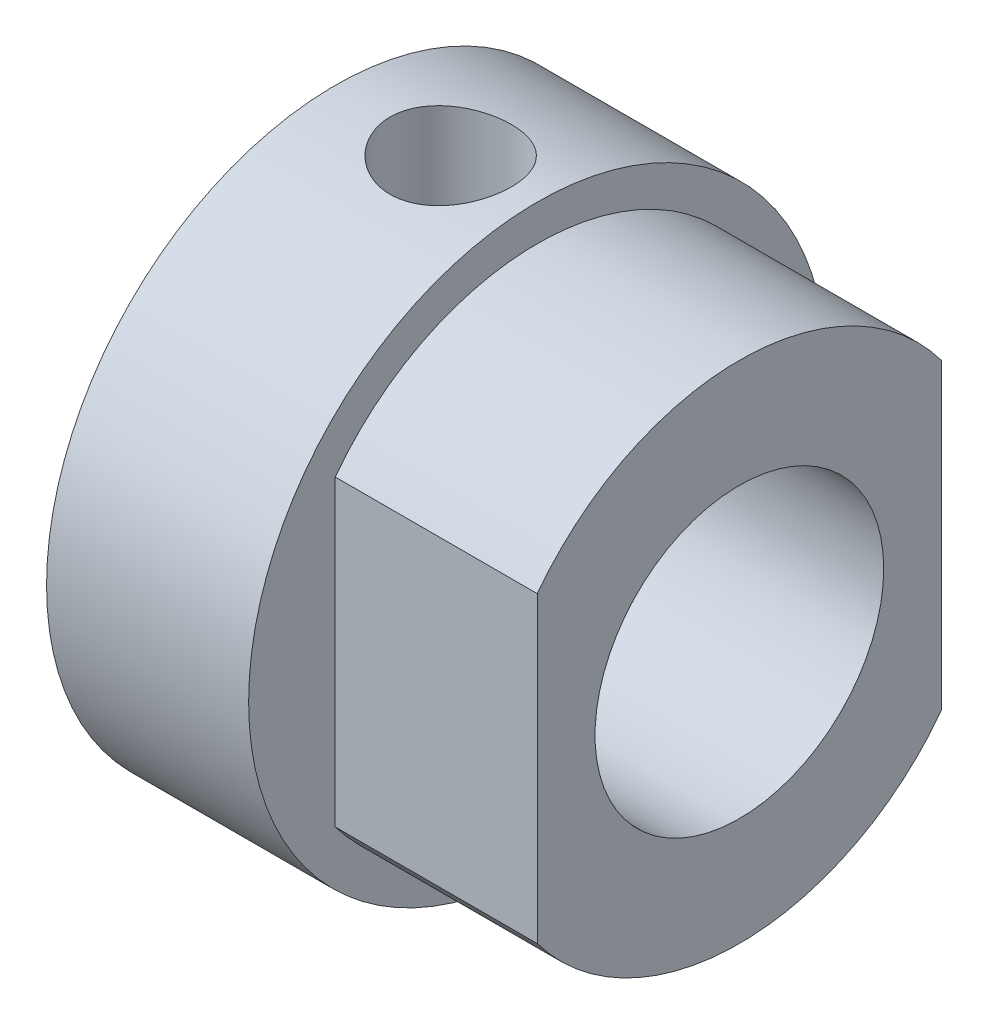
ISO-10303-21;
HEADER;
FILE_DESCRIPTION(('STEP AP214'),'2;1');
FILE_NAME('part.step','',(''),(''),'','','');
FILE_SCHEMA(('AUTOMOTIVE_DESIGN { 1 0 10303 214 1 1 1 1 }'));
ENDSEC;
DATA;
#1=APPLICATION_CONTEXT('core data for automotive mechanical design processes');
#2=APPLICATION_PROTOCOL_DEFINITION('international standard','automotive_design',2000,#1);
#3=PRODUCT_CONTEXT('',#1,'mechanical');
#4=PRODUCT('Part','Part','',(#3));
#5=PRODUCT_RELATED_PRODUCT_CATEGORY('part','',(#4));
#6=PRODUCT_DEFINITION_FORMATION('','',#4);
#7=PRODUCT_DEFINITION_CONTEXT('part definition',#1,'design');
#8=PRODUCT_DEFINITION('design','',#6,#7);
#9=PRODUCT_DEFINITION_SHAPE('','',#8);
#10=(LENGTH_UNIT() NAMED_UNIT(*) SI_UNIT(.MILLI.,.METRE.));
#11=(NAMED_UNIT(*) PLANE_ANGLE_UNIT() SI_UNIT($,.RADIAN.));
#12=(NAMED_UNIT(*) SI_UNIT($,.STERADIAN.) SOLID_ANGLE_UNIT());
#13=UNCERTAINTY_MEASURE_WITH_UNIT(LENGTH_MEASURE(1.E-05),#10,'distance_accuracy_value','');
#14=(GEOMETRIC_REPRESENTATION_CONTEXT(3) GLOBAL_UNCERTAINTY_ASSIGNED_CONTEXT((#13)) GLOBAL_UNIT_ASSIGNED_CONTEXT((#10,
#11,#12)) REPRESENTATION_CONTEXT('',''));
#15=CARTESIAN_POINT('',(0.,0.,0.));
#16=DIRECTION('',(0.,0.,1.));
#17=DIRECTION('',(1.,0.,0.));
#18=AXIS2_PLACEMENT_3D('',#15,#16,#17);
#19=CARTESIAN_POINT('',(0.,0.,0.));
#20=DIRECTION('',(1.,0.,0.));
#21=DIRECTION('',(0.,0.,-1.));
#22=AXIS2_PLACEMENT_3D('',#19,#20,#21);
#23=CYLINDRICAL_SURFACE('',#22,8.75);
#24=DIRECTION('',(-1.,0.,0.));
#25=VECTOR('',#24,1.);
#26=CARTESIAN_POINT('',(0.,5.25,-7.));
#27=LINE('',#26,#25);
#28=CARTESIAN_POINT('',(-7.,5.25,-7.));
#29=VERTEX_POINT('',#28);
#30=CARTESIAN_POINT('',(0.,5.25,-7.));
#31=VERTEX_POINT('',#30);
#32=EDGE_CURVE('E56',#29,#31,#27,.F.);
#33=ORIENTED_EDGE('',*,*,#32,.F.);
#34=CARTESIAN_POINT('',(-7.,0.,0.));
#35=DIRECTION('',(1.,0.,0.));
#36=DIRECTION('',(0.,0.,-1.));
#37=AXIS2_PLACEMENT_3D('',#34,#35,#36);
#38=CIRCLE('',#37,8.75);
#39=CARTESIAN_POINT('',(-7.,5.25,7.));
#40=VERTEX_POINT('',#39);
#41=EDGE_CURVE('E21',#29,#40,#38,.T.);
#42=ORIENTED_EDGE('',*,*,#41,.T.);
#43=DIRECTION('',(1.,0.,0.));
#44=VECTOR('',#43,1.);
#45=CARTESIAN_POINT('',(0.,5.25,7.));
#46=LINE('',#45,#44);
#47=CARTESIAN_POINT('',(0.,5.25,7.));
#48=VERTEX_POINT('',#47);
#49=EDGE_CURVE('E63',#48,#40,#46,.F.);
#50=ORIENTED_EDGE('',*,*,#49,.F.);
#51=CARTESIAN_POINT('',(0.,0.,0.));
#52=DIRECTION('',(1.,0.,0.));
#53=DIRECTION('',(0.,0.,-1.));
#54=AXIS2_PLACEMENT_3D('',#51,#52,#53);
#55=CIRCLE('',#54,8.75);
#56=EDGE_CURVE('E89',#31,#48,#55,.T.);
#57=ORIENTED_EDGE('',*,*,#56,.F.);
#58=EDGE_LOOP('',(#33,#42,#50,#57));
#59=FACE_BOUND('',#58,.T.);
#60=ADVANCED_FACE('F17',(#59),#23,.T.);
#61=CARTESIAN_POINT('',(0.,5.25,7.));
#62=DIRECTION('',(0.,0.,1.));
#63=DIRECTION('',(1.,0.,0.));
#64=AXIS2_PLACEMENT_3D('',#61,#62,#63);
#65=PLANE('',#64);
#66=ORIENTED_EDGE('',*,*,#49,.T.);
#67=DIRECTION('',(0.,1.,0.));
#68=VECTOR('',#67,1.);
#69=CARTESIAN_POINT('',(-7.,0.,7.));
#70=LINE('',#69,#68);
#71=CARTESIAN_POINT('',(-7.,-5.25,7.));
#72=VERTEX_POINT('',#71);
#73=EDGE_CURVE('E67',#40,#72,#70,.F.);
#74=ORIENTED_EDGE('',*,*,#73,.T.);
#75=DIRECTION('',(1.,0.,0.));
#76=VECTOR('',#75,1.);
#77=CARTESIAN_POINT('',(0.,-5.25,7.));
#78=LINE('',#77,#76);
#79=CARTESIAN_POINT('',(0.,-5.25,7.));
#80=VERTEX_POINT('',#79);
#81=EDGE_CURVE('E69',#80,#72,#78,.F.);
#82=ORIENTED_EDGE('',*,*,#81,.F.);
#83=DIRECTION('',(0.,1.,0.));
#84=VECTOR('',#83,1.);
#85=CARTESIAN_POINT('',(0.,0.,7.));
#86=LINE('',#85,#84);
#87=EDGE_CURVE('E68',#48,#80,#86,.F.);
#88=ORIENTED_EDGE('',*,*,#87,.F.);
#89=EDGE_LOOP('',(#66,#74,#82,#88));
#90=FACE_BOUND('',#89,.T.);
#91=ADVANCED_FACE('F65',(#90),#65,.T.);
#92=CARTESIAN_POINT('',(0.,0.,0.));
#93=DIRECTION('',(1.,0.,0.));
#94=DIRECTION('',(0.,0.,-1.));
#95=AXIS2_PLACEMENT_3D('',#92,#93,#94);
#96=CYLINDRICAL_SURFACE('',#95,8.75);
#97=ORIENTED_EDGE('',*,*,#81,.T.);
#98=CARTESIAN_POINT('',(-7.,0.,0.));
#99=DIRECTION('',(1.,0.,0.));
#100=DIRECTION('',(0.,0.,-1.));
#101=AXIS2_PLACEMENT_3D('',#98,#99,#100);
#102=CIRCLE('',#101,8.75);
#103=CARTESIAN_POINT('',(-7.,-5.25,-7.));
#104=VERTEX_POINT('',#103);
#105=EDGE_CURVE('E78',#72,#104,#102,.T.);
#106=ORIENTED_EDGE('',*,*,#105,.T.);
#107=DIRECTION('',(-1.,0.,0.));
#108=VECTOR('',#107,1.);
#109=CARTESIAN_POINT('',(0.,-5.25,-7.));
#110=LINE('',#109,#108);
#111=CARTESIAN_POINT('',(0.,-5.25,-7.));
#112=VERTEX_POINT('',#111);
#113=EDGE_CURVE('E81',#112,#104,#110,.T.);
#114=ORIENTED_EDGE('',*,*,#113,.F.);
#115=CARTESIAN_POINT('',(0.,0.,0.));
#116=DIRECTION('',(1.,0.,0.));
#117=DIRECTION('',(0.,0.,-1.));
#118=AXIS2_PLACEMENT_3D('',#115,#116,#117);
#119=CIRCLE('',#118,8.75);
#120=EDGE_CURVE('E36',#80,#112,#119,.T.);
#121=ORIENTED_EDGE('',*,*,#120,.F.);
#122=EDGE_LOOP('',(#97,#106,#114,#121));
#123=FACE_BOUND('',#122,.T.);
#124=ADVANCED_FACE('F123',(#123),#96,.T.);
#125=CARTESIAN_POINT('',(0.,-5.25,-7.));
#126=DIRECTION('',(0.,0.,-1.));
#127=DIRECTION('',(-1.,0.,0.));
#128=AXIS2_PLACEMENT_3D('',#125,#126,#127);
#129=PLANE('',#128);
#130=ORIENTED_EDGE('',*,*,#113,.T.);
#131=DIRECTION('',(0.,1.,0.));
#132=VECTOR('',#131,1.);
#133=CARTESIAN_POINT('',(-7.,0.,-7.));
#134=LINE('',#133,#132);
#135=EDGE_CURVE('E80',#104,#29,#134,.T.);
#136=ORIENTED_EDGE('',*,*,#135,.T.);
#137=ORIENTED_EDGE('',*,*,#32,.T.);
#138=DIRECTION('',(0.,1.,0.));
#139=VECTOR('',#138,1.);
#140=CARTESIAN_POINT('',(0.,0.,-7.));
#141=LINE('',#140,#139);
#142=EDGE_CURVE('E86',#112,#31,#141,.T.);
#143=ORIENTED_EDGE('',*,*,#142,.F.);
#144=EDGE_LOOP('',(#130,#136,#137,#143));
#145=FACE_BOUND('',#144,.T.);
#146=ADVANCED_FACE('F125',(#145),#129,.T.);
#147=CARTESIAN_POINT('',(-7.,0.,0.));
#148=DIRECTION('',(-1.,0.,0.));
#149=DIRECTION('',(0.,0.,1.));
#150=AXIS2_PLACEMENT_3D('',#147,#148,#149);
#151=PLANE('',#150);
#152=ORIENTED_EDGE('',*,*,#73,.F.);
#153=ORIENTED_EDGE('',*,*,#41,.F.);
#154=ORIENTED_EDGE('',*,*,#135,.F.);
#155=ORIENTED_EDGE('',*,*,#105,.F.);
#156=EDGE_LOOP('',(#152,#153,#154,#155));
#157=FACE_BOUND('',#156,.T.);
#158=CARTESIAN_POINT('',(-7.,0.,0.));
#159=DIRECTION('',(-1.,0.,0.));
#160=DIRECTION('',(0.,0.,1.));
#161=AXIS2_PLACEMENT_3D('',#158,#159,#160);
#162=CIRCLE('',#161,10.);
#163=CARTESIAN_POINT('',(-7.,0.,10.));
#164=VERTEX_POINT('',#163);
#165=EDGE_CURVE('E120',#164,#164,#162,.T.);
#166=ORIENTED_EDGE('',*,*,#165,.F.);
#167=EDGE_LOOP('',(#166));
#168=FACE_BOUND('',#167,.T.);
#169=ADVANCED_FACE('F73',(#157,#168),#151,.F.);
#170=CARTESIAN_POINT('',(0.,0.,0.));
#171=DIRECTION('',(1.,0.,0.));
#172=DIRECTION('',(0.,0.,-1.));
#173=AXIS2_PLACEMENT_3D('',#170,#171,#172);
#174=PLANE('',#173);
#175=CARTESIAN_POINT('',(0.,0.,0.));
#176=DIRECTION('',(1.,0.,0.));
#177=DIRECTION('',(0.,0.,-1.));
#178=AXIS2_PLACEMENT_3D('',#175,#176,#177);
#179=CIRCLE('',#178,5.);
#180=CARTESIAN_POINT('',(0.,0.,-5.));
#181=VERTEX_POINT('',#180);
#182=EDGE_CURVE('E101',#181,#181,#179,.F.);
#183=ORIENTED_EDGE('',*,*,#182,.T.);
#184=EDGE_LOOP('',(#183));
#185=FACE_BOUND('',#184,.T.);
#186=ORIENTED_EDGE('',*,*,#120,.T.);
#187=ORIENTED_EDGE('',*,*,#142,.T.);
#188=ORIENTED_EDGE('',*,*,#56,.T.);
#189=ORIENTED_EDGE('',*,*,#87,.T.);
#190=EDGE_LOOP('',(#186,#187,#188,#189));
#191=FACE_BOUND('',#190,.T.);
#192=ADVANCED_FACE('F126',(#185,#191),#174,.T.);
#193=CARTESIAN_POINT('',(-10.,0.,0.));
#194=DIRECTION('',(0.,1.,0.));
#195=DIRECTION('',(0.,0.,1.));
#196=AXIS2_PLACEMENT_3D('',#193,#194,#195);
#197=CYLINDRICAL_SURFACE('',#196,2.1);
#198=CARTESIAN_POINT('',(-12.1,10.,0.));
#199=CARTESIAN_POINT('',(-12.0999943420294,9.99999714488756,-0.116461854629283));
#200=CARTESIAN_POINT('',(-12.0902699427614,9.99794269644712,-0.233066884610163));
#201=CARTESIAN_POINT('',(-12.0516373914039,9.98993854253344,-0.463068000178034));
#202=CARTESIAN_POINT('',(-12.0226916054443,9.98398119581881,-0.576457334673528));
#203=CARTESIAN_POINT('',(-11.9465544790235,9.96883601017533,-0.796526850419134));
#204=CARTESIAN_POINT('',(-11.8993899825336,9.9596529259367,-0.903216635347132));
#205=CARTESIAN_POINT('',(-11.7882252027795,9.93905320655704,-1.10713016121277));
#206=CARTESIAN_POINT('',(-11.7242302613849,9.92763728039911,-1.20435689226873));
#207=CARTESIAN_POINT('',(-11.5801996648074,9.90363238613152,-1.38808312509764));
#208=CARTESIAN_POINT('',(-11.4999601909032,9.89102972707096,-1.47442108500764));
#209=CARTESIAN_POINT('',(-11.3261523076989,9.86616926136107,-1.63252084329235));
#210=CARTESIAN_POINT('',(-11.2325820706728,9.85391150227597,-1.70428063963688));
#211=CARTESIAN_POINT('',(-11.0336049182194,9.83099649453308,-1.83187516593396));
#212=CARTESIAN_POINT('',(-10.9280880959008,9.82035664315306,-1.88754190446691));
#213=CARTESIAN_POINT('',(-10.7089387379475,9.80207584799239,-1.9802925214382));
#214=CARTESIAN_POINT('',(-10.595307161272,9.79443455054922,-2.01737859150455));
#215=CARTESIAN_POINT('',(-10.364884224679,9.78315377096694,-2.07139083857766));
#216=CARTESIAN_POINT('',(-10.2481618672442,9.77945828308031,-2.0885994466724));
#217=CARTESIAN_POINT('',(-10.0134325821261,9.77631916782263,-2.10324601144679));
#218=CARTESIAN_POINT('',(-9.89542579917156,9.7768750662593,-2.10068617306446));
#219=CARTESIAN_POINT('',(-9.66356230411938,9.78212511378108,-2.07609635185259));
#220=CARTESIAN_POINT('',(-9.54966919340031,9.78674993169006,-2.0543925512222));
#221=CARTESIAN_POINT('',(-9.32717669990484,9.7995073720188,-1.99264647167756));
#222=CARTESIAN_POINT('',(-9.21857763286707,9.80764020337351,-1.95260310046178));
#223=CARTESIAN_POINT('',(-9.00882576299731,9.82656713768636,-1.8550079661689));
#224=CARTESIAN_POINT('',(-8.90773423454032,9.83738055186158,-1.79732841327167));
#225=CARTESIAN_POINT('',(-8.716550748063,9.86043714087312,-1.66619265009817));
#226=CARTESIAN_POINT('',(-8.62645938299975,9.87268039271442,-1.59273558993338));
#227=CARTESIAN_POINT('',(-8.45796046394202,9.89751445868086,-1.43040806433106));
#228=CARTESIAN_POINT('',(-8.37981816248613,9.91010736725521,-1.34126236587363));
#229=CARTESIAN_POINT('',(-8.23951828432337,9.9340072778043,-1.15094828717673));
#230=CARTESIAN_POINT('',(-8.17736769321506,9.94531371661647,-1.04977468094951));
#231=CARTESIAN_POINT('',(-8.07076125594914,9.96540039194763,-0.837939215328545));
#232=CARTESIAN_POINT('',(-8.02635227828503,9.97417392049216,-0.727253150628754));
#233=CARTESIAN_POINT('',(-7.95692261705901,9.98814259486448,-0.499906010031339));
#234=CARTESIAN_POINT('',(-7.93186129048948,9.9933452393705,-0.383258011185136));
#235=CARTESIAN_POINT('',(-7.91123272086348,9.99764626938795,-0.221423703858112));
#236=CARTESIAN_POINT('',(-7.90702414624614,9.99852690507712,-0.177254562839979));
#237=CARTESIAN_POINT('',(-7.90140670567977,9.99970431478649,-0.088730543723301));
#238=CARTESIAN_POINT('',(-7.89999784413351,10.0000010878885,-0.0443756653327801));
#239=CARTESIAN_POINT('',(-7.90000565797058,9.99999714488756,0.116461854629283));
#240=CARTESIAN_POINT('',(-7.90973005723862,9.99794269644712,0.233066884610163));
#241=CARTESIAN_POINT('',(-7.94836260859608,9.98993854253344,0.463068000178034));
#242=CARTESIAN_POINT('',(-7.97730839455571,9.98398119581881,0.576457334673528));
#243=CARTESIAN_POINT('',(-8.05344552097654,9.96883601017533,0.796526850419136));
#244=CARTESIAN_POINT('',(-8.10061001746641,9.9596529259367,0.903216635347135));
#245=CARTESIAN_POINT('',(-8.21177479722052,9.93905320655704,1.10713016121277));
#246=CARTESIAN_POINT('',(-8.27576973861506,9.92763728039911,1.20435689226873));
#247=CARTESIAN_POINT('',(-8.41980033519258,9.90363238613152,1.38808312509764));
#248=CARTESIAN_POINT('',(-8.50003980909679,9.89102972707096,1.47442108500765));
#249=CARTESIAN_POINT('',(-8.67384769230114,9.86616926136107,1.63252084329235));
#250=CARTESIAN_POINT('',(-8.7674179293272,9.85391150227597,1.70428063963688));
#251=CARTESIAN_POINT('',(-8.96639508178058,9.83099649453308,1.83187516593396));
#252=CARTESIAN_POINT('',(-9.07191190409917,9.82035664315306,1.88754190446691));
#253=CARTESIAN_POINT('',(-9.2910612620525,9.80207584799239,1.98029252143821));
#254=CARTESIAN_POINT('',(-9.40469283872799,9.79443455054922,2.01737859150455));
#255=CARTESIAN_POINT('',(-9.63511577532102,9.78315377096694,2.07139083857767));
#256=CARTESIAN_POINT('',(-9.75183813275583,9.77945828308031,2.0885994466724));
#257=CARTESIAN_POINT('',(-9.98656741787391,9.77631916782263,2.10324601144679));
#258=CARTESIAN_POINT('',(-10.1045742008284,9.7768750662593,2.10068617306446));
#259=CARTESIAN_POINT('',(-10.3364376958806,9.78212511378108,2.07609635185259));
#260=CARTESIAN_POINT('',(-10.4503308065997,9.78674993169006,2.0543925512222));
#261=CARTESIAN_POINT('',(-10.6728233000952,9.7995073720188,1.99264647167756));
#262=CARTESIAN_POINT('',(-10.7814223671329,9.80764020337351,1.95260310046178));
#263=CARTESIAN_POINT('',(-10.9911742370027,9.82656713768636,1.8550079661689));
#264=CARTESIAN_POINT('',(-11.0922657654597,9.83738055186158,1.79732841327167));
#265=CARTESIAN_POINT('',(-11.283449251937,9.86043714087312,1.66619265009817));
#266=CARTESIAN_POINT('',(-11.3735406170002,9.87268039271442,1.59273558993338));
#267=CARTESIAN_POINT('',(-11.542039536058,9.89751445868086,1.43040806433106));
#268=CARTESIAN_POINT('',(-11.6201818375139,9.91010736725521,1.34126236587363));
#269=CARTESIAN_POINT('',(-11.7604817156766,9.9340072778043,1.15094828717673));
#270=CARTESIAN_POINT('',(-11.8226323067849,9.94531371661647,1.04977468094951));
#271=CARTESIAN_POINT('',(-11.9292387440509,9.96540039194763,0.837939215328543));
#272=CARTESIAN_POINT('',(-11.973647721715,9.97417392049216,0.727253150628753));
#273=CARTESIAN_POINT('',(-12.043077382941,9.98814259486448,0.499906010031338));
#274=CARTESIAN_POINT('',(-12.0681387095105,9.9933452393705,0.383258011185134));
#275=CARTESIAN_POINT('',(-12.0887672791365,9.99764626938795,0.221423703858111));
#276=CARTESIAN_POINT('',(-12.0929758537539,9.99852690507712,0.177254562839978));
#277=CARTESIAN_POINT('',(-12.0985932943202,9.99970431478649,0.0887305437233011));
#278=CARTESIAN_POINT('',(-12.1000021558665,10.0000010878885,0.04437566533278));
#279=CARTESIAN_POINT('',(-12.1,10.,0.));
#280=B_SPLINE_CURVE_WITH_KNOTS('',3,(#198,#199,#200,#201,#202,#203,#204,#205,#206,#207,#208,
#209,#210,#211,#212,#213,#214,#215,#216,#217,#218,#219,#220,#221,#222,#223,#224,#225,#226,#227,
#228,#229,#230,#231,#232,#233,#234,#235,#236,#237,#238,#239,#240,#241,#242,#243,#244,#245,#246,
#247,#248,#249,#250,#251,#252,#253,#254,#255,#256,#257,#258,#259,#260,#261,#262,#263,#264,#265,
#266,#267,#268,#269,#270,#271,#272,#273,#274,#275,#276,#277,#278,#279),.UNSPECIFIED.,.T.,.F.,(4,
2,2,2,2,2,2,2,2,2,2,2,2,2,2,2,2,2,2,2,2,2,2,2,2,2,2,2,2,2,2,2,2,2,2,2,2,2,2,2,4),(0.,
0.349215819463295,0.699117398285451,1.04850537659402,1.39778259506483,1.75174900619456,
2.10576399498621,2.46335103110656,2.82089587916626,3.1732954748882,3.52565576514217,
3.87212592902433,4.21861673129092,4.567680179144,4.91676243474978,5.27272431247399,
5.62884142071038,5.98589316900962,6.34219281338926,6.47525492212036,6.60831724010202,
6.95753305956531,7.30743463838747,7.65682261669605,8.00609983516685,8.36006624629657,
8.71408123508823,9.07166827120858,9.42921311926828,9.78161271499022,10.1339730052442,
10.4804431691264,10.8269339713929,11.175997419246,11.5250796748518,11.881041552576,
12.2371586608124,12.5942104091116,12.9505100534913,13.0835721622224,13.216634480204),.UNSPECIFIED.);
#281=CARTESIAN_POINT('',(-12.1,10.,0.));
#282=VERTEX_POINT('',#281);
#283=EDGE_CURVE('E88',#282,#282,#280,.T.);
#284=ORIENTED_EDGE('',*,*,#283,.F.);
#285=EDGE_LOOP('',(#284));
#286=FACE_BOUND('',#285,.T.);
#287=CARTESIAN_POINT('',(-7.9,5.,0.));
#288=CARTESIAN_POINT('',(-7.9000065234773,4.99999469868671,0.112528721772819));
#289=CARTESIAN_POINT('',(-7.90908928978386,4.99616148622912,0.225149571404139));
#290=CARTESIAN_POINT('',(-7.94505918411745,4.98121717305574,0.447096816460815));
#291=CARTESIAN_POINT('',(-7.97197047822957,4.97009619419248,0.556418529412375));
#292=CARTESIAN_POINT('',(-8.04242740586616,4.94176660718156,0.768336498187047));
#293=CARTESIAN_POINT('',(-8.08592399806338,4.92457595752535,0.87095154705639));
#294=CARTESIAN_POINT('',(-8.18809457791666,4.88577253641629,1.06736277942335));
#295=CARTESIAN_POINT('',(-8.24676883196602,4.86415968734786,1.16115880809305));
#296=CARTESIAN_POINT('',(-8.38076405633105,4.8174479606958,1.34213733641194));
#297=CARTESIAN_POINT('',(-8.45673043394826,4.79223395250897,1.42881195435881));
#298=CARTESIAN_POINT('',(-8.62178347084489,4.74165722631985,1.58862387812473));
#299=CARTESIAN_POINT('',(-8.71087617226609,4.71629444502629,1.66175491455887));
#300=CARTESIAN_POINT('',(-8.9050774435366,4.66686374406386,1.79604142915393));
#301=CARTESIAN_POINT('',(-9.01076556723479,4.64292478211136,1.85641123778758));
#302=CARTESIAN_POINT('',(-9.23194797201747,4.6008869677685,1.95828984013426));
#303=CARTESIAN_POINT('',(-9.34743720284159,4.58278513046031,1.99980827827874));
#304=CARTESIAN_POINT('',(-9.57908132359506,4.5557228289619,2.0606933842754));
#305=CARTESIAN_POINT('',(-9.69492956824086,4.54635991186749,2.08104086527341));
#306=CARTESIAN_POINT('',(-9.92874526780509,4.53668036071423,2.10206556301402));
#307=CARTESIAN_POINT('',(-10.0467114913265,4.53635863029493,2.10275386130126));
#308=CARTESIAN_POINT('',(-10.2715726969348,4.54445782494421,2.08517839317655));
#309=CARTESIAN_POINT('',(-10.3786125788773,4.55219765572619,2.06839113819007));
#310=CARTESIAN_POINT('',(-10.588185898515,4.57439531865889,2.01882071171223));
#311=CARTESIAN_POINT('',(-10.6907184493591,4.58885446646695,1.98603440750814));
#312=CARTESIAN_POINT('',(-10.8909790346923,4.62318991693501,1.90475453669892));
#313=CARTESIAN_POINT('',(-10.9885567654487,4.64317580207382,1.85593902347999));
#314=CARTESIAN_POINT('',(-11.1745157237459,4.68628734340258,1.74421616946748));
#315=CARTESIAN_POINT('',(-11.2628936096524,4.70941413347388,1.68130373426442));
#316=CARTESIAN_POINT('',(-11.4359375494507,4.7586184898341,1.53683175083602));
#317=CARTESIAN_POINT('',(-11.5196330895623,4.78477890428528,1.45413482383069));
#318=CARTESIAN_POINT('',(-11.6723196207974,4.83543741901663,1.2755973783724));
#319=CARTESIAN_POINT('',(-11.7413031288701,4.85993466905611,1.17975021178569));
#320=CARTESIAN_POINT('',(-11.8640705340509,4.9052441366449,0.974614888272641));
#321=CARTESIAN_POINT('',(-11.9174425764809,4.92595187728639,0.865055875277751));
#322=CARTESIAN_POINT('',(-12.0045810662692,4.96051713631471,0.637518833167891));
#323=CARTESIAN_POINT('',(-12.0383865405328,4.97438828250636,0.519558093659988));
#324=CARTESIAN_POINT('',(-12.0743975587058,4.98928935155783,0.333710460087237));
#325=CARTESIAN_POINT('',(-12.0839816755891,4.99329013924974,0.267407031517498));
#326=CARTESIAN_POINT('',(-12.0967847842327,4.99864701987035,0.134079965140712));
#327=CARTESIAN_POINT('',(-12.1000038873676,5.00000315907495,0.067056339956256));
#328=CARTESIAN_POINT('',(-12.0999934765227,4.99999469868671,-0.11252872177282));
#329=CARTESIAN_POINT('',(-12.0909107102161,4.99616148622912,-0.225149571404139));
#330=CARTESIAN_POINT('',(-12.0549408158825,4.98121717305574,-0.447096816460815));
#331=CARTESIAN_POINT('',(-12.0280295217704,4.97009619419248,-0.556418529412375));
#332=CARTESIAN_POINT('',(-11.9575725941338,4.94176660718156,-0.768336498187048));
#333=CARTESIAN_POINT('',(-11.9140760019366,4.92457595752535,-0.87095154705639));
#334=CARTESIAN_POINT('',(-11.8119054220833,4.88577253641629,-1.06736277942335));
#335=CARTESIAN_POINT('',(-11.753231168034,4.86415968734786,-1.16115880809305));
#336=CARTESIAN_POINT('',(-11.6192359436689,4.8174479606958,-1.34213733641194));
#337=CARTESIAN_POINT('',(-11.5432695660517,4.79223395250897,-1.42881195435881));
#338=CARTESIAN_POINT('',(-11.3782165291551,4.74165722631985,-1.58862387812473));
#339=CARTESIAN_POINT('',(-11.2891238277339,4.71629444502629,-1.66175491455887));
#340=CARTESIAN_POINT('',(-11.0949225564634,4.66686374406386,-1.79604142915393));
#341=CARTESIAN_POINT('',(-10.9892344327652,4.64292478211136,-1.85641123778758));
#342=CARTESIAN_POINT('',(-10.7680520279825,4.6008869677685,-1.95828984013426));
#343=CARTESIAN_POINT('',(-10.6525627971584,4.58278513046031,-1.99980827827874));
#344=CARTESIAN_POINT('',(-10.4209186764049,4.5557228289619,-2.0606933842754));
#345=CARTESIAN_POINT('',(-10.3050704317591,4.54635991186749,-2.08104086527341));
#346=CARTESIAN_POINT('',(-10.0712547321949,4.53668036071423,-2.10206556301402));
#347=CARTESIAN_POINT('',(-9.9532885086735,4.53635863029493,-2.10275386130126));
#348=CARTESIAN_POINT('',(-9.72842730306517,4.54445782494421,-2.08517839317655));
#349=CARTESIAN_POINT('',(-9.62138742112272,4.55219765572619,-2.06839113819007));
#350=CARTESIAN_POINT('',(-9.41181410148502,4.57439531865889,-2.01882071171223));
#351=CARTESIAN_POINT('',(-9.3092815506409,4.58885446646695,-1.98603440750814));
#352=CARTESIAN_POINT('',(-9.10902096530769,4.62318991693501,-1.90475453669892));
#353=CARTESIAN_POINT('',(-9.01144323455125,4.64317580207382,-1.85593902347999));
#354=CARTESIAN_POINT('',(-8.82548427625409,4.68628734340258,-1.74421616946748));
#355=CARTESIAN_POINT('',(-8.73710639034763,4.70941413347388,-1.68130373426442));
#356=CARTESIAN_POINT('',(-8.56406245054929,4.7586184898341,-1.53683175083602));
#357=CARTESIAN_POINT('',(-8.48036691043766,4.78477890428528,-1.45413482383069));
#358=CARTESIAN_POINT('',(-8.32768037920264,4.83543741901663,-1.27559737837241));
#359=CARTESIAN_POINT('',(-8.25869687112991,4.85993466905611,-1.17975021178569));
#360=CARTESIAN_POINT('',(-8.13592946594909,4.9052441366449,-0.974614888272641));
#361=CARTESIAN_POINT('',(-8.08255742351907,4.92595187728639,-0.865055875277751));
#362=CARTESIAN_POINT('',(-7.99541893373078,4.96051713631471,-0.637518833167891));
#363=CARTESIAN_POINT('',(-7.96161345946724,4.97438828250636,-0.519558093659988));
#364=CARTESIAN_POINT('',(-7.92560244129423,4.98928935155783,-0.333710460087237));
#365=CARTESIAN_POINT('',(-7.91601832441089,4.99329013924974,-0.267407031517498));
#366=CARTESIAN_POINT('',(-7.90321521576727,4.99864701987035,-0.134079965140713));
#367=CARTESIAN_POINT('',(-7.89999611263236,5.00000315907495,-0.0670563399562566));
#368=CARTESIAN_POINT('',(-7.9,5.,0.));
#369=B_SPLINE_CURVE_WITH_KNOTS('',3,(#287,#288,#289,#290,#291,#292,#293,#294,#295,#296,#297,
#298,#299,#300,#301,#302,#303,#304,#305,#306,#307,#308,#309,#310,#311,#312,#313,#314,#315,#316,
#317,#318,#319,#320,#321,#322,#323,#324,#325,#326,#327,#328,#329,#330,#331,#332,#333,#334,#335,
#336,#337,#338,#339,#340,#341,#342,#343,#344,#345,#346,#347,#348,#349,#350,#351,#352,#353,#354,
#355,#356,#357,#358,#359,#360,#361,#362,#363,#364,#365,#366,#367,#368),.UNSPECIFIED.,.T.,.F.,(4,
2,2,2,2,2,2,2,2,2,2,2,2,2,2,2,2,2,2,2,2,2,2,2,2,2,2,2,2,2,2,2,2,2,2,2,2,2,2,2,4),(0.,
0.337325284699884,0.675108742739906,1.01190105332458,1.34869927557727,1.70110458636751,
2.0536726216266,2.42394328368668,2.79402429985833,3.14607233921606,3.49792193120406,
3.82228173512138,4.14670507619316,4.47808981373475,4.80959450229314,5.16956743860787,
5.52972303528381,5.8986647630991,6.26686805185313,6.46788512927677,6.66889868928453,
7.00622397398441,7.34400743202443,7.68079974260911,8.0175979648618,8.37000327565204,
8.72257131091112,9.0928419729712,9.46292298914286,9.81497102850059,10.1668206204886,
10.4911804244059,10.8156037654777,11.1469885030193,11.4784931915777,11.8384661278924,
12.1986217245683,12.5675634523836,12.9357667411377,13.1367838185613,13.3377973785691),.UNSPECIFIED.);
#370=CARTESIAN_POINT('',(-7.9,5.,0.));
#371=VERTEX_POINT('',#370);
#372=EDGE_CURVE('E95',#371,#371,#369,.T.);
#373=ORIENTED_EDGE('',*,*,#372,.T.);
#374=EDGE_LOOP('',(#373));
#375=FACE_BOUND('',#374,.T.);
#376=ADVANCED_FACE('F103',(#286,#375),#197,.F.);
#377=CARTESIAN_POINT('',(-14.,0.,0.));
#378=DIRECTION('',(-1.,0.,0.));
#379=DIRECTION('',(0.,0.,1.));
#380=AXIS2_PLACEMENT_3D('',#377,#378,#379);
#381=CYLINDRICAL_SURFACE('',#380,10.);
#382=ORIENTED_EDGE('',*,*,#165,.T.);
#383=EDGE_LOOP('',(#382));
#384=FACE_BOUND('',#383,.T.);
#385=CARTESIAN_POINT('',(-14.,0.,0.));
#386=DIRECTION('',(-1.,0.,0.));
#387=DIRECTION('',(0.,0.,1.));
#388=AXIS2_PLACEMENT_3D('',#385,#386,#387);
#389=CIRCLE('',#388,10.);
#390=CARTESIAN_POINT('',(-14.,0.,10.));
#391=VERTEX_POINT('',#390);
#392=EDGE_CURVE('E27',#391,#391,#389,.F.);
#393=ORIENTED_EDGE('',*,*,#392,.T.);
#394=EDGE_LOOP('',(#393));
#395=FACE_BOUND('',#394,.T.);
#396=ORIENTED_EDGE('',*,*,#283,.T.);
#397=EDGE_LOOP('',(#396));
#398=FACE_BOUND('',#397,.T.);
#399=ADVANCED_FACE('F110',(#384,#395,#398),#381,.T.);
#400=CARTESIAN_POINT('',(0.,0.,0.));
#401=DIRECTION('',(1.,0.,0.));
#402=DIRECTION('',(0.,0.,-1.));
#403=AXIS2_PLACEMENT_3D('',#400,#401,#402);
#404=CYLINDRICAL_SURFACE('',#403,5.);
#405=CARTESIAN_POINT('',(-14.,0.,0.));
#406=DIRECTION('',(1.,0.,0.));
#407=DIRECTION('',(0.,0.,-1.));
#408=AXIS2_PLACEMENT_3D('',#405,#406,#407);
#409=CIRCLE('',#408,5.);
#410=CARTESIAN_POINT('',(-14.,0.,-5.));
#411=VERTEX_POINT('',#410);
#412=EDGE_CURVE('E11',#411,#411,#409,.F.);
#413=ORIENTED_EDGE('',*,*,#412,.T.);
#414=EDGE_LOOP('',(#413));
#415=FACE_BOUND('',#414,.T.);
#416=ORIENTED_EDGE('',*,*,#372,.F.);
#417=EDGE_LOOP('',(#416));
#418=FACE_BOUND('',#417,.T.);
#419=ORIENTED_EDGE('',*,*,#182,.F.);
#420=EDGE_LOOP('',(#419));
#421=FACE_BOUND('',#420,.T.);
#422=ADVANCED_FACE('F107',(#415,#418,#421),#404,.F.);
#423=CARTESIAN_POINT('',(-14.,0.,0.));
#424=DIRECTION('',(1.,0.,0.));
#425=DIRECTION('',(0.,0.,-1.));
#426=AXIS2_PLACEMENT_3D('',#423,#424,#425);
#427=PLANE('',#426);
#428=ORIENTED_EDGE('',*,*,#412,.F.);
#429=EDGE_LOOP('',(#428));
#430=FACE_BOUND('',#429,.T.);
#431=ORIENTED_EDGE('',*,*,#392,.F.);
#432=EDGE_LOOP('',(#431));
#433=FACE_BOUND('',#432,.T.);
#434=ADVANCED_FACE('F19',(#430,#433),#427,.F.);
#435=CLOSED_SHELL('',(#60,#91,#124,#146,#169,#192,#376,#399,#422,#434));
#436=MANIFOLD_SOLID_BREP('B1',#435);
#437=ADVANCED_BREP_SHAPE_REPRESENTATION('',(#18,#436),#14);
#438=SHAPE_DEFINITION_REPRESENTATION(#9,#437);
ENDSEC;
END-ISO-10303-21;
